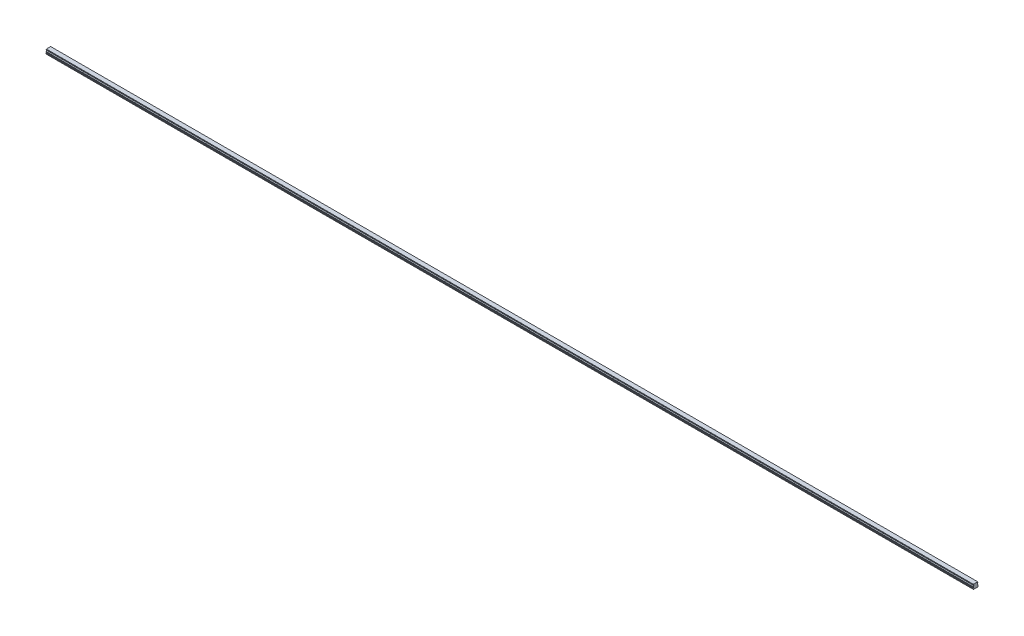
from build123d import *

# Parameters (mm, degrees)
BOSS_EXTRUDE1_DEPTH        = 2820
SKETCH3_R                  = 2.5
SKETCH3_R_2                = 2.1
CUT_EXTRUDE3_DEPTH         = 7
SKETCH3_2_R                = 2.1
CUT_EXTRUDE4_DEPTH         = 9.5
CHAMFER1_SIZE              = 0.4
LPATTERN2_COUNT            = 47
LPATTERN2_PITCH            = 60
CHAMFER1_OF_LPATTERN2_SIZE = 0.4


with BuildPart() as part:
    # Sketch1 → Boss-Extrude1 (new body)
    with BuildSketch(Plane(origin=(0, 0, 0), x_dir=(0, 0, -1), z_dir=(1, 0, 0))):
        with BuildLine():
            Line((6.59, 14), (-6.59, 14))
            Line((-6.59, 14), (-6.59, 13.15))
            Line((-6.59, 13.15), (-6.96, 12.356532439))
            Line((-6.96, 12.356532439), (-6.96, 11.435174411))
            ThreePointArc((-6.96, 11.435174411), (-5.25, 9.5), (-6.96, 7.564825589))
            Line((-6.96, 7.564825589), (-6.96, 6.643467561))
            Line((-6.96, 6.643467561), (-6.59, 5.85))
            Line((-6.59, 5.85), (-7.032116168, 4.2))
            Line((-7.032116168, 4.2), (-7.5, 3.929867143))
            Line((-7.5, 3.929867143), (-7.5, 1.4))
            Line((-7.5, 1.4), (-6.1, 0))
            Line((-6.1, 0), (-3.65, 0))
            Line((-3.65, 0), (-3.25, 0.4))
            Line((-3.25, 0.4), (3.25, 0.4))
            Line((3.25, 0.4), (3.65, 0))
            Line((3.65, 0), (6.1, 0))
            Line((6.1, 0), (7.5, 1.4))
            Line((7.5, 1.4), (7.5, 3.929867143))
            Line((7.5, 3.929867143), (7.032116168, 4.2))
            Line((7.032116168, 4.2), (6.59, 5.85))
            Line((6.59, 5.85), (6.96, 6.643467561))
            Line((6.96, 6.643467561), (6.96, 7.564825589))
            ThreePointArc((6.96, 7.564825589), (5.25, 9.5), (6.96, 11.435174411))
            Line((6.96, 11.435174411), (6.96, 12.356532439))
            Line((6.96, 12.356532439), (6.59, 13.15))
            Line((6.59, 13.15), (6.59, 14))
        make_face()
    extrude(amount=BOSS_EXTRUDE1_DEPTH)

    # Sketch3 → Cut-Extrude3 (cut)
    with BuildSketch(Plane.XZ):
        with Locations(Location((30, 0, 0), (0, 0, 270))):
            Circle(SKETCH3_R)
        with Locations(Location((30, 0, 0), (0, 0, 270))):
            Circle(SKETCH3_R_2, mode=Mode.SUBTRACT)
    cut_extrude3 = extrude(amount=-CUT_EXTRUDE3_DEPTH, mode=Mode.SUBTRACT)

    # Sketch3_2 → Cut-Extrude4 (cut)
    with BuildSketch(Plane.XZ):
        with Locations(Location((30, 0, 0), (0, 0, 270))):
            Circle(SKETCH3_2_R)
    cut_extrude4 = extrude(amount=-CUT_EXTRUDE4_DEPTH, mode=Mode.SUBTRACT)

    # Cut-Extrude5 cone 1 section (on through the dimple's axis) → Cut-Extrude5 (revolve, cut)
    with BuildSketch(Plane(origin=(30, 9.5, 0), x_dir=(0, 0, -1), z_dir=(1, 0, 0))):
        Polygon((0, 0), (2.1, 0), (0, 1.212435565), align=None)
    revolve(axis=Axis((30, 9.5, 0), (0, 1, 0)), mode=Mode.SUBTRACT)

    # Chamfer1
    chamfer1_edges = [part.edges().sort_by_distance(p)[0] for p in [
        (30, 0.4, 2.5),
    ]]
    chamfer(chamfer1_edges, length=CHAMFER1_SIZE)

    # LPattern2: Cut-Extrude3, Cut-Extrude4 ×47
    with Locations(*[(i * LPATTERN2_PITCH, 0, 0) for i in range(1, LPATTERN2_COUNT)]):
        add(cut_extrude3, mode=Mode.SUBTRACT)
        add(cut_extrude4, mode=Mode.SUBTRACT)

    # Chamfer1 of LPattern2
    chamfer1_of_lpattern2_edges = [part.edges().sort_by_distance(p)[0] for p in [
        (90, 0.4, 2.5),
        (150, 0.4, 2.5),
        (210, 0.4, 2.5),
        (270, 0.4, 2.5),
        (330, 0.4, 2.5),
        (390, 0.4, 2.5),
        (450, 0.4, 2.5),
        (510, 0.4, 2.5),
        (570, 0.4, 2.5),
        (630, 0.4, 2.5),
        (690, 0.4, 2.5),
        (750, 0.4, 2.5),
        (810, 0.4, 2.5),
        (870, 0.4, 2.5),
        (930, 0.4, 2.5),
        (990, 0.4, 2.5),
        (1050, 0.4, 2.5),
        (1110, 0.4, 2.5),
        (1170, 0.4, 2.5),
        (1230, 0.4, 2.5),
        (1290, 0.4, 2.5),
        (1350, 0.4, 2.5),
        (1410, 0.4, 2.5),
        (1470, 0.4, 2.5),
        (1530, 0.4, 2.5),
        (1590, 0.4, 2.5),
        (1650, 0.4, 2.5),
        (1710, 0.4, 2.5),
        (1770, 0.4, 2.5),
        (1830, 0.4, 2.5),
        (1890, 0.4, 2.5),
        (1950, 0.4, 2.5),
        (2010, 0.4, 2.5),
        (2070, 0.4, 2.5),
        (2130, 0.4, 2.5),
        (2190, 0.4, 2.5),
        (2250, 0.4, 2.5),
        (2310, 0.4, 2.5),
        (2370, 0.4, 2.5),
        (2430, 0.4, 2.5),
        (2490, 0.4, 2.5),
        (2550, 0.4, 2.5),
        (2610, 0.4, 2.5),
        (2670, 0.4, 2.5),
        (2730, 0.4, 2.5),
        (2790, 0.4, 2.5),
    ]]
    chamfer(chamfer1_of_lpattern2_edges, length=CHAMFER1_OF_LPATTERN2_SIZE)


solid = part.part
